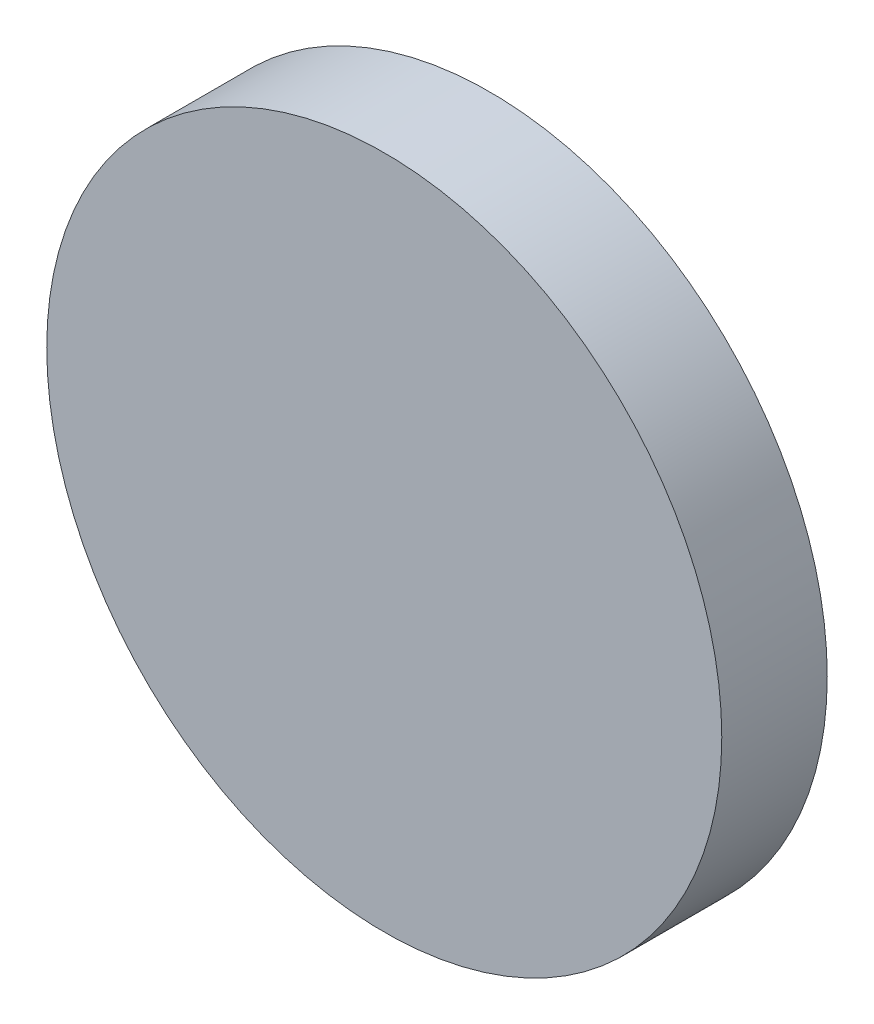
from build123d import *

# Parameters (mm, degrees)
SKETCH1_R           = 6.4
BOSS_EXTRUDE1_DEPTH = 2


with BuildPart() as part:
    # Sketch1 → Boss-Extrude1 (new body)
    with BuildSketch(Plane.XY):
        Circle(SKETCH1_R)
    extrude(amount=BOSS_EXTRUDE1_DEPTH)


solid = part.part
